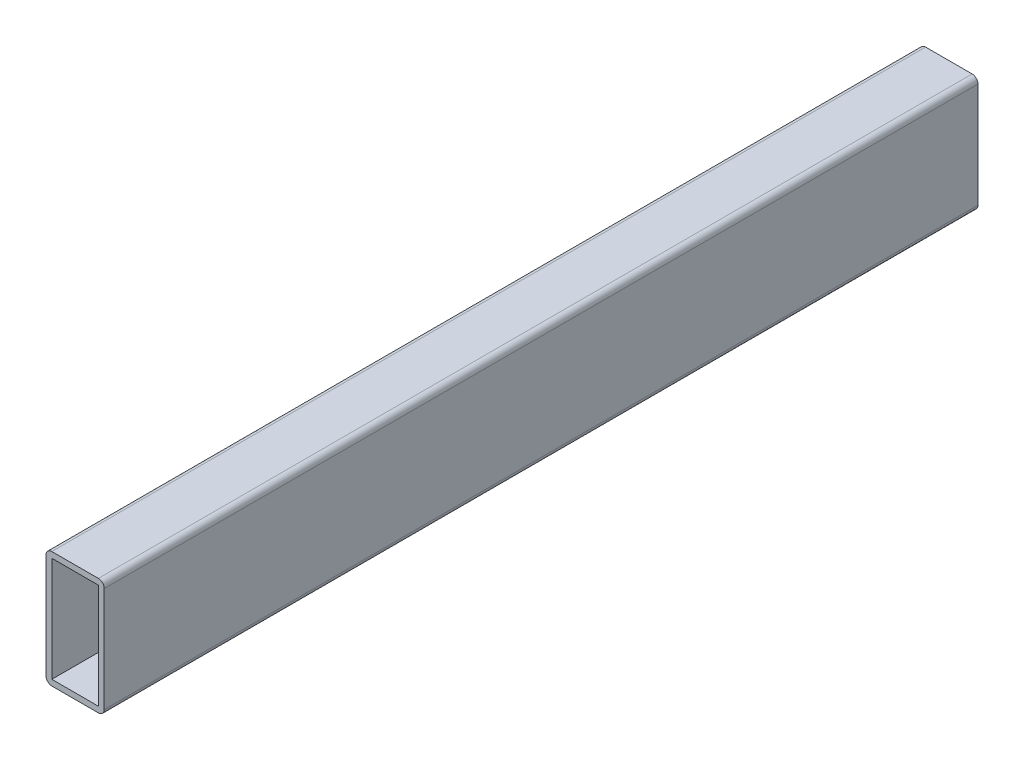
ISO-10303-21;
HEADER;
FILE_DESCRIPTION(('STEP AP214'),'2;1');
FILE_NAME('part.step','',(''),(''),'','','');
FILE_SCHEMA(('AUTOMOTIVE_DESIGN { 1 0 10303 214 1 1 1 1 }'));
ENDSEC;
DATA;
#1=APPLICATION_CONTEXT('core data for automotive mechanical design processes');
#2=APPLICATION_PROTOCOL_DEFINITION('international standard','automotive_design',2000,#1);
#3=PRODUCT_CONTEXT('',#1,'mechanical');
#4=PRODUCT('Part','Part','',(#3));
#5=PRODUCT_RELATED_PRODUCT_CATEGORY('part','',(#4));
#6=PRODUCT_DEFINITION_FORMATION('','',#4);
#7=PRODUCT_DEFINITION_CONTEXT('part definition',#1,'design');
#8=PRODUCT_DEFINITION('design','',#6,#7);
#9=PRODUCT_DEFINITION_SHAPE('','',#8);
#10=(LENGTH_UNIT() NAMED_UNIT(*) SI_UNIT(.MILLI.,.METRE.));
#11=(NAMED_UNIT(*) PLANE_ANGLE_UNIT() SI_UNIT($,.RADIAN.));
#12=(NAMED_UNIT(*) SI_UNIT($,.STERADIAN.) SOLID_ANGLE_UNIT());
#13=UNCERTAINTY_MEASURE_WITH_UNIT(LENGTH_MEASURE(1.E-05),#10,'distance_accuracy_value','');
#14=(GEOMETRIC_REPRESENTATION_CONTEXT(3) GLOBAL_UNCERTAINTY_ASSIGNED_CONTEXT((#13)) GLOBAL_UNIT_ASSIGNED_CONTEXT((#10,
#11,#12)) REPRESENTATION_CONTEXT('',''));
#15=CARTESIAN_POINT('',(0.,0.,0.));
#16=DIRECTION('',(0.,0.,1.));
#17=DIRECTION('',(1.,0.,0.));
#18=AXIS2_PLACEMENT_3D('',#15,#16,#17);
#19=CARTESIAN_POINT('',(-18.,-2.,300.));
#20=DIRECTION('',(0.,0.,1.));
#21=DIRECTION('',(1.,0.,0.));
#22=AXIS2_PLACEMENT_3D('',#19,#20,#21);
#23=PLANE('',#22);
#24=CARTESIAN_POINT('',(-18.,-2.,300.));
#25=DIRECTION('',(0.,0.,1.));
#26=DIRECTION('',(1.,0.,0.));
#27=AXIS2_PLACEMENT_3D('',#24,#25,#26);
#28=CIRCLE('',#27,2.);
#29=CARTESIAN_POINT('',(-18.,0.,300.));
#30=VERTEX_POINT('',#29);
#31=CARTESIAN_POINT('',(-20.,-2.00000000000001,300.));
#32=VERTEX_POINT('',#31);
#33=EDGE_CURVE('E159',#30,#32,#28,.T.);
#34=ORIENTED_EDGE('',*,*,#33,.T.);
#35=DIRECTION('',(0.,-1.,0.));
#36=VECTOR('',#35,1.);
#37=CARTESIAN_POINT('',(-20.,-2.00000000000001,300.));
#38=LINE('',#37,#36);
#39=CARTESIAN_POINT('',(-20.,-38.,300.));
#40=VERTEX_POINT('',#39);
#41=EDGE_CURVE('E162',#32,#40,#38,.T.);
#42=ORIENTED_EDGE('',*,*,#41,.T.);
#43=CARTESIAN_POINT('',(-18.,-38.,300.));
#44=DIRECTION('',(0.,0.,1.));
#45=DIRECTION('',(-1.,0.,0.));
#46=AXIS2_PLACEMENT_3D('',#43,#44,#45);
#47=CIRCLE('',#46,2.);
#48=CARTESIAN_POINT('',(-18.,-40.,300.));
#49=VERTEX_POINT('',#48);
#50=EDGE_CURVE('E165',#40,#49,#47,.T.);
#51=ORIENTED_EDGE('',*,*,#50,.T.);
#52=DIRECTION('',(1.,0.,0.));
#53=VECTOR('',#52,1.);
#54=CARTESIAN_POINT('',(-2.00000000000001,-40.,300.));
#55=LINE('',#54,#53);
#56=CARTESIAN_POINT('',(-2.00000000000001,-40.,300.));
#57=VERTEX_POINT('',#56);
#58=EDGE_CURVE('E167',#49,#57,#55,.T.);
#59=ORIENTED_EDGE('',*,*,#58,.T.);
#60=CARTESIAN_POINT('',(-2.,-38.,300.));
#61=DIRECTION('',(0.,0.,1.));
#62=DIRECTION('',(-1.,0.,0.));
#63=AXIS2_PLACEMENT_3D('',#60,#61,#62);
#64=CIRCLE('',#63,2.);
#65=CARTESIAN_POINT('',(0.,-38.,300.));
#66=VERTEX_POINT('',#65);
#67=EDGE_CURVE('E169',#57,#66,#64,.T.);
#68=ORIENTED_EDGE('',*,*,#67,.T.);
#69=DIRECTION('',(0.,1.,0.));
#70=VECTOR('',#69,1.);
#71=CARTESIAN_POINT('',(0.,-2.00000000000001,300.));
#72=LINE('',#71,#70);
#73=CARTESIAN_POINT('',(0.,-2.00000000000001,300.));
#74=VERTEX_POINT('',#73);
#75=EDGE_CURVE('E171',#66,#74,#72,.T.);
#76=ORIENTED_EDGE('',*,*,#75,.T.);
#77=CARTESIAN_POINT('',(-2.,-2.,300.));
#78=DIRECTION('',(0.,0.,1.));
#79=DIRECTION('',(-1.,0.,0.));
#80=AXIS2_PLACEMENT_3D('',#77,#78,#79);
#81=CIRCLE('',#80,2.);
#82=CARTESIAN_POINT('',(-2.00000000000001,0.,300.));
#83=VERTEX_POINT('',#82);
#84=EDGE_CURVE('E173',#74,#83,#81,.T.);
#85=ORIENTED_EDGE('',*,*,#84,.T.);
#86=DIRECTION('',(-1.,0.,0.));
#87=VECTOR('',#86,1.);
#88=CARTESIAN_POINT('',(-2.00000000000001,0.,300.));
#89=LINE('',#88,#87);
#90=EDGE_CURVE('E175',#83,#30,#89,.T.);
#91=ORIENTED_EDGE('',*,*,#90,.T.);
#92=EDGE_LOOP('',(#34,#42,#51,#59,#68,#76,#85,#91));
#93=FACE_BOUND('',#92,.T.);
#94=DIRECTION('',(-1.,0.,0.));
#95=VECTOR('',#94,1.);
#96=CARTESIAN_POINT('',(-2.00000000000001,-2.,300.));
#97=LINE('',#96,#95);
#98=CARTESIAN_POINT('',(-2.00000000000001,-2.,300.));
#99=VERTEX_POINT('',#98);
#100=CARTESIAN_POINT('',(-18.,-2.,300.));
#101=VERTEX_POINT('',#100);
#102=EDGE_CURVE('E131',#99,#101,#97,.T.);
#103=ORIENTED_EDGE('',*,*,#102,.F.);
#104=DIRECTION('',(0.,1.,0.));
#105=VECTOR('',#104,1.);
#106=CARTESIAN_POINT('',(-2.,-2.00000000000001,300.));
#107=LINE('',#106,#105);
#108=CARTESIAN_POINT('',(-2.00000000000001,-38.,300.));
#109=VERTEX_POINT('',#108);
#110=EDGE_CURVE('E123',#109,#99,#107,.T.);
#111=ORIENTED_EDGE('',*,*,#110,.F.);
#112=DIRECTION('',(1.,0.,0.));
#113=VECTOR('',#112,1.);
#114=CARTESIAN_POINT('',(-2.00000000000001,-38.,300.));
#115=LINE('',#114,#113);
#116=CARTESIAN_POINT('',(-18.,-38.,300.));
#117=VERTEX_POINT('',#116);
#118=EDGE_CURVE('E145',#117,#109,#115,.T.);
#119=ORIENTED_EDGE('',*,*,#118,.F.);
#120=DIRECTION('',(0.,-1.,0.));
#121=VECTOR('',#120,1.);
#122=CARTESIAN_POINT('',(-18.,-2.,300.));
#123=LINE('',#122,#121);
#124=EDGE_CURVE('E143',#101,#117,#123,.T.);
#125=ORIENTED_EDGE('',*,*,#124,.F.);
#126=EDGE_LOOP('',(#103,#111,#119,#125));
#127=FACE_BOUND('',#126,.T.);
#128=ADVANCED_FACE('F34',(#93,#127),#23,.T.);
#129=CARTESIAN_POINT('',(-18.,-2.,0.));
#130=DIRECTION('',(0.,0.,1.));
#131=DIRECTION('',(1.,0.,0.));
#132=AXIS2_PLACEMENT_3D('',#129,#130,#131);
#133=PLANE('',#132);
#134=CARTESIAN_POINT('',(-18.,-2.,0.));
#135=DIRECTION('',(0.,0.,1.));
#136=DIRECTION('',(1.,0.,0.));
#137=AXIS2_PLACEMENT_3D('',#134,#135,#136);
#138=CIRCLE('',#137,2.);
#139=CARTESIAN_POINT('',(-18.,0.,0.));
#140=VERTEX_POINT('',#139);
#141=CARTESIAN_POINT('',(-20.,-2.00000000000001,0.));
#142=VERTEX_POINT('',#141);
#143=EDGE_CURVE('E139',#140,#142,#138,.T.);
#144=ORIENTED_EDGE('',*,*,#143,.F.);
#145=DIRECTION('',(-1.,0.,0.));
#146=VECTOR('',#145,1.);
#147=CARTESIAN_POINT('',(-2.00000000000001,0.,0.));
#148=LINE('',#147,#146);
#149=CARTESIAN_POINT('',(-2.00000000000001,0.,0.));
#150=VERTEX_POINT('',#149);
#151=EDGE_CURVE('E163',#150,#140,#148,.T.);
#152=ORIENTED_EDGE('',*,*,#151,.F.);
#153=CARTESIAN_POINT('',(-2.,-2.,0.));
#154=DIRECTION('',(0.,0.,1.));
#155=DIRECTION('',(-1.,0.,0.));
#156=AXIS2_PLACEMENT_3D('',#153,#154,#155);
#157=CIRCLE('',#156,2.);
#158=CARTESIAN_POINT('',(0.,-2.00000000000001,0.));
#159=VERTEX_POINT('',#158);
#160=EDGE_CURVE('E190',#159,#150,#157,.T.);
#161=ORIENTED_EDGE('',*,*,#160,.F.);
#162=DIRECTION('',(0.,1.,0.));
#163=VECTOR('',#162,1.);
#164=CARTESIAN_POINT('',(0.,-2.00000000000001,0.));
#165=LINE('',#164,#163);
#166=CARTESIAN_POINT('',(0.,-38.,0.));
#167=VERTEX_POINT('',#166);
#168=EDGE_CURVE('E188',#167,#159,#165,.T.);
#169=ORIENTED_EDGE('',*,*,#168,.F.);
#170=CARTESIAN_POINT('',(-2.,-38.,0.));
#171=DIRECTION('',(0.,0.,1.));
#172=DIRECTION('',(-1.,0.,0.));
#173=AXIS2_PLACEMENT_3D('',#170,#171,#172);
#174=CIRCLE('',#173,2.);
#175=CARTESIAN_POINT('',(-2.00000000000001,-40.,0.));
#176=VERTEX_POINT('',#175);
#177=EDGE_CURVE('E186',#176,#167,#174,.T.);
#178=ORIENTED_EDGE('',*,*,#177,.F.);
#179=DIRECTION('',(1.,0.,0.));
#180=VECTOR('',#179,1.);
#181=CARTESIAN_POINT('',(-2.00000000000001,-40.,0.));
#182=LINE('',#181,#180);
#183=CARTESIAN_POINT('',(-18.,-40.,0.));
#184=VERTEX_POINT('',#183);
#185=EDGE_CURVE('E184',#184,#176,#182,.T.);
#186=ORIENTED_EDGE('',*,*,#185,.F.);
#187=CARTESIAN_POINT('',(-18.,-38.,0.));
#188=DIRECTION('',(0.,0.,1.));
#189=DIRECTION('',(-1.,0.,0.));
#190=AXIS2_PLACEMENT_3D('',#187,#188,#189);
#191=CIRCLE('',#190,2.);
#192=CARTESIAN_POINT('',(-20.,-38.,0.));
#193=VERTEX_POINT('',#192);
#194=EDGE_CURVE('E182',#193,#184,#191,.T.);
#195=ORIENTED_EDGE('',*,*,#194,.F.);
#196=DIRECTION('',(0.,-1.,0.));
#197=VECTOR('',#196,1.);
#198=CARTESIAN_POINT('',(-20.,-2.00000000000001,0.));
#199=LINE('',#198,#197);
#200=EDGE_CURVE('E180',#142,#193,#199,.T.);
#201=ORIENTED_EDGE('',*,*,#200,.F.);
#202=EDGE_LOOP('',(#144,#152,#161,#169,#178,#186,#195,#201));
#203=FACE_BOUND('',#202,.T.);
#204=DIRECTION('',(0.,1.,0.));
#205=VECTOR('',#204,1.);
#206=CARTESIAN_POINT('',(-2.,-2.00000000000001,0.));
#207=LINE('',#206,#205);
#208=CARTESIAN_POINT('',(-2.00000000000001,-38.,0.));
#209=VERTEX_POINT('',#208);
#210=CARTESIAN_POINT('',(-2.00000000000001,-2.,0.));
#211=VERTEX_POINT('',#210);
#212=EDGE_CURVE('E57',#209,#211,#207,.T.);
#213=ORIENTED_EDGE('',*,*,#212,.T.);
#214=DIRECTION('',(-1.,0.,0.));
#215=VECTOR('',#214,1.);
#216=CARTESIAN_POINT('',(-2.00000000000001,-2.,0.));
#217=LINE('',#216,#215);
#218=CARTESIAN_POINT('',(-18.,-2.,0.));
#219=VERTEX_POINT('',#218);
#220=EDGE_CURVE('E138',#211,#219,#217,.T.);
#221=ORIENTED_EDGE('',*,*,#220,.T.);
#222=DIRECTION('',(0.,-1.,0.));
#223=VECTOR('',#222,1.);
#224=CARTESIAN_POINT('',(-18.,-2.,0.));
#225=LINE('',#224,#223);
#226=CARTESIAN_POINT('',(-18.,-38.,0.));
#227=VERTEX_POINT('',#226);
#228=EDGE_CURVE('E151',#219,#227,#225,.T.);
#229=ORIENTED_EDGE('',*,*,#228,.T.);
#230=DIRECTION('',(1.,0.,0.));
#231=VECTOR('',#230,1.);
#232=CARTESIAN_POINT('',(-2.00000000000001,-38.,0.));
#233=LINE('',#232,#231);
#234=EDGE_CURVE('E132',#227,#209,#233,.T.);
#235=ORIENTED_EDGE('',*,*,#234,.T.);
#236=EDGE_LOOP('',(#213,#221,#229,#235));
#237=FACE_BOUND('',#236,.T.);
#238=ADVANCED_FACE('F220',(#203,#237),#133,.F.);
#239=CARTESIAN_POINT('',(-18.,-2.,300.));
#240=DIRECTION('',(0.,0.,-1.));
#241=DIRECTION('',(-1.,0.,0.));
#242=AXIS2_PLACEMENT_3D('',#239,#240,#241);
#243=CYLINDRICAL_SURFACE('',#242,2.);
#244=ORIENTED_EDGE('',*,*,#143,.T.);
#245=DIRECTION('',(0.,0.,-1.));
#246=VECTOR('',#245,1.);
#247=CARTESIAN_POINT('',(-20.,-2.00000000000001,300.));
#248=LINE('',#247,#246);
#249=EDGE_CURVE('E11',#32,#142,#248,.T.);
#250=ORIENTED_EDGE('',*,*,#249,.F.);
#251=ORIENTED_EDGE('',*,*,#33,.F.);
#252=DIRECTION('',(0.,0.,-1.));
#253=VECTOR('',#252,1.);
#254=CARTESIAN_POINT('',(-18.,0.,300.));
#255=LINE('',#254,#253);
#256=EDGE_CURVE('E177',#30,#140,#255,.T.);
#257=ORIENTED_EDGE('',*,*,#256,.T.);
#258=EDGE_LOOP('',(#244,#250,#251,#257));
#259=FACE_BOUND('',#258,.T.);
#260=ADVANCED_FACE('F36',(#259),#243,.T.);
#261=CARTESIAN_POINT('',(-20.,-2.00000000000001,300.));
#262=DIRECTION('',(1.,0.,0.));
#263=DIRECTION('',(0.,1.,0.));
#264=AXIS2_PLACEMENT_3D('',#261,#262,#263);
#265=PLANE('',#264);
#266=ORIENTED_EDGE('',*,*,#200,.T.);
#267=DIRECTION('',(0.,0.,-1.));
#268=VECTOR('',#267,1.);
#269=CARTESIAN_POINT('',(-20.,-38.,300.));
#270=LINE('',#269,#268);
#271=EDGE_CURVE('E42',#40,#193,#270,.T.);
#272=ORIENTED_EDGE('',*,*,#271,.F.);
#273=ORIENTED_EDGE('',*,*,#41,.F.);
#274=ORIENTED_EDGE('',*,*,#249,.T.);
#275=EDGE_LOOP('',(#266,#272,#273,#274));
#276=FACE_BOUND('',#275,.T.);
#277=ADVANCED_FACE('F237',(#276),#265,.F.);
#278=CARTESIAN_POINT('',(-18.,-38.,300.));
#279=DIRECTION('',(0.,0.,-1.));
#280=DIRECTION('',(-1.,0.,0.));
#281=AXIS2_PLACEMENT_3D('',#278,#279,#280);
#282=CYLINDRICAL_SURFACE('',#281,2.);
#283=ORIENTED_EDGE('',*,*,#194,.T.);
#284=DIRECTION('',(0.,0.,-1.));
#285=VECTOR('',#284,1.);
#286=CARTESIAN_POINT('',(-18.,-40.,300.));
#287=LINE('',#286,#285);
#288=EDGE_CURVE('E207',#49,#184,#287,.T.);
#289=ORIENTED_EDGE('',*,*,#288,.F.);
#290=ORIENTED_EDGE('',*,*,#50,.F.);
#291=ORIENTED_EDGE('',*,*,#271,.T.);
#292=EDGE_LOOP('',(#283,#289,#290,#291));
#293=FACE_BOUND('',#292,.T.);
#294=ADVANCED_FACE('F214',(#293),#282,.T.);
#295=CARTESIAN_POINT('',(-2.00000000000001,-40.,300.));
#296=DIRECTION('',(0.,1.,0.));
#297=DIRECTION('',(0.,0.,1.));
#298=AXIS2_PLACEMENT_3D('',#295,#296,#297);
#299=PLANE('',#298);
#300=ORIENTED_EDGE('',*,*,#185,.T.);
#301=DIRECTION('',(0.,0.,-1.));
#302=VECTOR('',#301,1.);
#303=CARTESIAN_POINT('',(-2.00000000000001,-40.,300.));
#304=LINE('',#303,#302);
#305=EDGE_CURVE('E204',#57,#176,#304,.T.);
#306=ORIENTED_EDGE('',*,*,#305,.F.);
#307=ORIENTED_EDGE('',*,*,#58,.F.);
#308=ORIENTED_EDGE('',*,*,#288,.T.);
#309=EDGE_LOOP('',(#300,#306,#307,#308));
#310=FACE_BOUND('',#309,.T.);
#311=ADVANCED_FACE('F226',(#310),#299,.F.);
#312=CARTESIAN_POINT('',(-2.,-38.,300.));
#313=DIRECTION('',(0.,0.,-1.));
#314=DIRECTION('',(-1.,0.,0.));
#315=AXIS2_PLACEMENT_3D('',#312,#313,#314);
#316=CYLINDRICAL_SURFACE('',#315,2.);
#317=ORIENTED_EDGE('',*,*,#177,.T.);
#318=DIRECTION('',(0.,0.,-1.));
#319=VECTOR('',#318,1.);
#320=CARTESIAN_POINT('',(0.,-38.,300.));
#321=LINE('',#320,#319);
#322=EDGE_CURVE('E201',#66,#167,#321,.T.);
#323=ORIENTED_EDGE('',*,*,#322,.F.);
#324=ORIENTED_EDGE('',*,*,#67,.F.);
#325=ORIENTED_EDGE('',*,*,#305,.T.);
#326=EDGE_LOOP('',(#317,#323,#324,#325));
#327=FACE_BOUND('',#326,.T.);
#328=ADVANCED_FACE('F230',(#327),#316,.T.);
#329=CARTESIAN_POINT('',(0.,-2.00000000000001,300.));
#330=DIRECTION('',(-1.,0.,0.));
#331=DIRECTION('',(0.,-1.,0.));
#332=AXIS2_PLACEMENT_3D('',#329,#330,#331);
#333=PLANE('',#332);
#334=ORIENTED_EDGE('',*,*,#168,.T.);
#335=DIRECTION('',(0.,0.,-1.));
#336=VECTOR('',#335,1.);
#337=CARTESIAN_POINT('',(0.,-2.00000000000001,300.));
#338=LINE('',#337,#336);
#339=EDGE_CURVE('E198',#74,#159,#338,.T.);
#340=ORIENTED_EDGE('',*,*,#339,.F.);
#341=ORIENTED_EDGE('',*,*,#75,.F.);
#342=ORIENTED_EDGE('',*,*,#322,.T.);
#343=EDGE_LOOP('',(#334,#340,#341,#342));
#344=FACE_BOUND('',#343,.T.);
#345=ADVANCED_FACE('F250',(#344),#333,.F.);
#346=CARTESIAN_POINT('',(-2.,-2.,300.));
#347=DIRECTION('',(0.,0.,-1.));
#348=DIRECTION('',(-1.,0.,0.));
#349=AXIS2_PLACEMENT_3D('',#346,#347,#348);
#350=CYLINDRICAL_SURFACE('',#349,2.);
#351=ORIENTED_EDGE('',*,*,#160,.T.);
#352=DIRECTION('',(0.,0.,-1.));
#353=VECTOR('',#352,1.);
#354=CARTESIAN_POINT('',(-2.00000000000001,0.,300.));
#355=LINE('',#354,#353);
#356=EDGE_CURVE('E195',#83,#150,#355,.T.);
#357=ORIENTED_EDGE('',*,*,#356,.F.);
#358=ORIENTED_EDGE('',*,*,#84,.F.);
#359=ORIENTED_EDGE('',*,*,#339,.T.);
#360=EDGE_LOOP('',(#351,#357,#358,#359));
#361=FACE_BOUND('',#360,.T.);
#362=ADVANCED_FACE('F248',(#361),#350,.T.);
#363=CARTESIAN_POINT('',(-2.00000000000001,0.,300.));
#364=DIRECTION('',(0.,-1.,0.));
#365=DIRECTION('',(0.,0.,-1.));
#366=AXIS2_PLACEMENT_3D('',#363,#364,#365);
#367=PLANE('',#366);
#368=ORIENTED_EDGE('',*,*,#151,.T.);
#369=ORIENTED_EDGE('',*,*,#256,.F.);
#370=ORIENTED_EDGE('',*,*,#90,.F.);
#371=ORIENTED_EDGE('',*,*,#356,.T.);
#372=EDGE_LOOP('',(#368,#369,#370,#371));
#373=FACE_BOUND('',#372,.T.);
#374=ADVANCED_FACE('F243',(#373),#367,.F.);
#375=CARTESIAN_POINT('',(-2.,-2.00000000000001,300.));
#376=DIRECTION('',(-1.,0.,0.));
#377=DIRECTION('',(0.,-1.,0.));
#378=AXIS2_PLACEMENT_3D('',#375,#376,#377);
#379=PLANE('',#378);
#380=ORIENTED_EDGE('',*,*,#212,.F.);
#381=DIRECTION('',(0.,0.,-1.));
#382=VECTOR('',#381,1.);
#383=CARTESIAN_POINT('',(-2.00000000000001,-38.,300.));
#384=LINE('',#383,#382);
#385=EDGE_CURVE('E127',#109,#209,#384,.T.);
#386=ORIENTED_EDGE('',*,*,#385,.F.);
#387=ORIENTED_EDGE('',*,*,#110,.T.);
#388=DIRECTION('',(0.,0.,-1.));
#389=VECTOR('',#388,1.);
#390=CARTESIAN_POINT('',(-2.00000000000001,-2.,300.));
#391=LINE('',#390,#389);
#392=EDGE_CURVE('E126',#99,#211,#391,.T.);
#393=ORIENTED_EDGE('',*,*,#392,.T.);
#394=EDGE_LOOP('',(#380,#386,#387,#393));
#395=FACE_BOUND('',#394,.T.);
#396=ADVANCED_FACE('F125',(#395),#379,.T.);
#397=CARTESIAN_POINT('',(-2.00000000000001,-2.,300.));
#398=DIRECTION('',(0.,-1.,0.));
#399=DIRECTION('',(0.,0.,-1.));
#400=AXIS2_PLACEMENT_3D('',#397,#398,#399);
#401=PLANE('',#400);
#402=ORIENTED_EDGE('',*,*,#220,.F.);
#403=ORIENTED_EDGE('',*,*,#392,.F.);
#404=ORIENTED_EDGE('',*,*,#102,.T.);
#405=DIRECTION('',(0.,0.,-1.));
#406=VECTOR('',#405,1.);
#407=CARTESIAN_POINT('',(-18.,-2.,300.));
#408=LINE('',#407,#406);
#409=EDGE_CURVE('E140',#101,#219,#408,.T.);
#410=ORIENTED_EDGE('',*,*,#409,.T.);
#411=EDGE_LOOP('',(#402,#403,#404,#410));
#412=FACE_BOUND('',#411,.T.);
#413=ADVANCED_FACE('F135',(#412),#401,.T.);
#414=CARTESIAN_POINT('',(-18.,-2.,300.));
#415=DIRECTION('',(1.,0.,0.));
#416=DIRECTION('',(0.,1.,0.));
#417=AXIS2_PLACEMENT_3D('',#414,#415,#416);
#418=PLANE('',#417);
#419=ORIENTED_EDGE('',*,*,#228,.F.);
#420=ORIENTED_EDGE('',*,*,#409,.F.);
#421=ORIENTED_EDGE('',*,*,#124,.T.);
#422=DIRECTION('',(0.,0.,-1.));
#423=VECTOR('',#422,1.);
#424=CARTESIAN_POINT('',(-18.,-38.,300.));
#425=LINE('',#424,#423);
#426=EDGE_CURVE('E49',#117,#227,#425,.T.);
#427=ORIENTED_EDGE('',*,*,#426,.T.);
#428=EDGE_LOOP('',(#419,#420,#421,#427));
#429=FACE_BOUND('',#428,.T.);
#430=ADVANCED_FACE('F275',(#429),#418,.T.);
#431=CARTESIAN_POINT('',(-2.00000000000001,-38.,300.));
#432=DIRECTION('',(0.,1.,0.));
#433=DIRECTION('',(-1.,0.,0.));
#434=AXIS2_PLACEMENT_3D('',#431,#432,#433);
#435=PLANE('',#434);
#436=ORIENTED_EDGE('',*,*,#234,.F.);
#437=ORIENTED_EDGE('',*,*,#426,.F.);
#438=ORIENTED_EDGE('',*,*,#118,.T.);
#439=ORIENTED_EDGE('',*,*,#385,.T.);
#440=EDGE_LOOP('',(#436,#437,#438,#439));
#441=FACE_BOUND('',#440,.T.);
#442=ADVANCED_FACE('F279',(#441),#435,.T.);
#443=CLOSED_SHELL('',(#128,#238,#260,#277,#294,#311,#328,#345,#362,#374,#396,#413,#430,#442));
#444=MANIFOLD_SOLID_BREP('B2',#443);
#445=ADVANCED_BREP_SHAPE_REPRESENTATION('',(#18,#444),#14);
#446=SHAPE_DEFINITION_REPRESENTATION(#9,#445);
ENDSEC;
END-ISO-10303-21;
